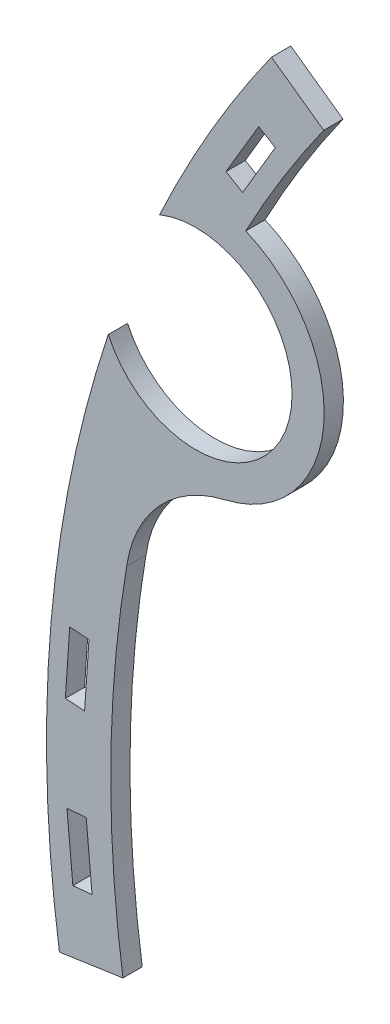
from build123d import *

# Parameters (mm, degrees)
AUFSATZ_LINEAR_AUSTRAGEN1_DEPTH = 3


with BuildPart() as part:
    # Skizze1 → Aufsatz-Linear austragen1 (new body)
    with BuildSketch(Plane.XY):
        with BuildLine():
            ThreePointArc((-179.672595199, 53.720518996), (-188.582229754, 10.588917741), (-187.283930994, -33.434156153))
            Line((-187.283930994, -33.434156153), (-177.385555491, -31.977869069))
            ThreePointArc((-177.385555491, -31.977869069), (-179.285318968, -4.010252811), (-176.802619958, 23.911653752))
            ThreePointArc((-176.802619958, 23.911653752), (-171.721880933, 34.556201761), (-161.526224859, 40.486539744))
            ThreePointArc((-161.526224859, 40.486539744), (-146.110894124, 58.253867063), (-158.258899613, 78.396764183))
            ThreePointArc((-158.258899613, 78.396764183), (-152.496742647, 88.423718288), (-146.100177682, 98.058354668))
            Line((-146.100177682, 98.058354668), (-154.248542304, 103.85526367))
            ThreePointArc((-154.248542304, 103.85526367), (-163.653397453, 89.262067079), (-171.681723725, 73.868605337))
            ThreePointArc((-171.681723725, 73.868605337), (-152.093620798, 54.441166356), (-179.672595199, 53.720518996))
        make_face()
        Polygon((-185.191835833, -23.413388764), (-186.108637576, -13.455503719), (-183.11430643, -13.179821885), (-182.197504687, -23.13770693), align=None, mode=Mode.SUBTRACT)
        Polygon((-183.366259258, 1.064171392), (-186.366259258, 1.269157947), (-185.684560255, 11.245895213), (-182.684560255, 11.040908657), align=None, mode=Mode.SUBTRACT)
        Polygon((-158.744235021, 83.338299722), (-161.331870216, 84.870018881), (-156.238017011, 93.475404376), (-153.650381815, 91.943685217), align=None, mode=Mode.SUBTRACT)
    extrude(amount=AUFSATZ_LINEAR_AUSTRAGEN1_DEPTH)


solid = part.part
